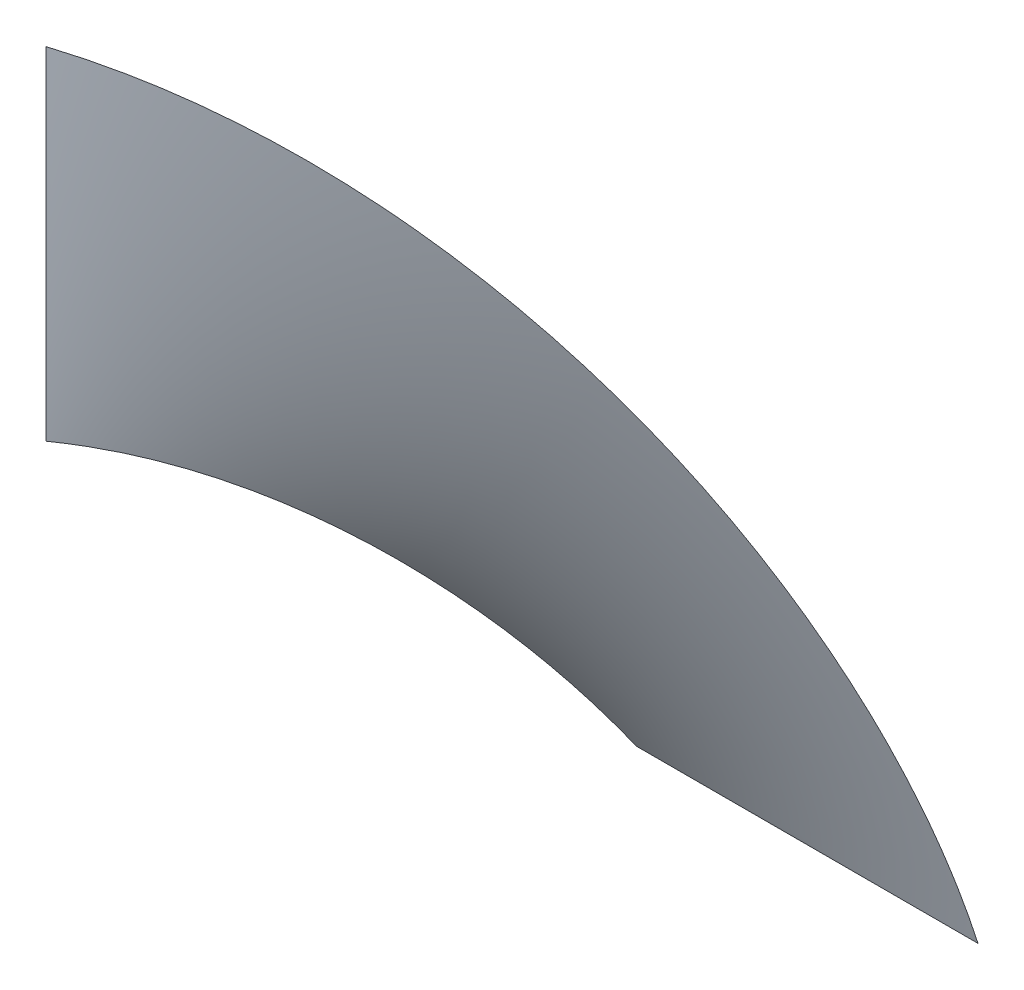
ISO-10303-21;
HEADER;
FILE_DESCRIPTION(('STEP AP214'),'2;1');
FILE_NAME('part.step','',(''),(''),'','','');
FILE_SCHEMA(('AUTOMOTIVE_DESIGN { 1 0 10303 214 1 1 1 1 }'));
ENDSEC;
DATA;
#1=APPLICATION_CONTEXT('core data for automotive mechanical design processes');
#2=APPLICATION_PROTOCOL_DEFINITION('international standard','automotive_design',2000,#1);
#3=PRODUCT_CONTEXT('',#1,'mechanical');
#4=PRODUCT('Part','Part','',(#3));
#5=PRODUCT_RELATED_PRODUCT_CATEGORY('part','',(#4));
#6=PRODUCT_DEFINITION_FORMATION('','',#4);
#7=PRODUCT_DEFINITION_CONTEXT('part definition',#1,'design');
#8=PRODUCT_DEFINITION('design','',#6,#7);
#9=PRODUCT_DEFINITION_SHAPE('','',#8);
#10=(LENGTH_UNIT() NAMED_UNIT(*) SI_UNIT(.MILLI.,.METRE.));
#11=(NAMED_UNIT(*) PLANE_ANGLE_UNIT() SI_UNIT($,.RADIAN.));
#12=(NAMED_UNIT(*) SI_UNIT($,.STERADIAN.) SOLID_ANGLE_UNIT());
#13=UNCERTAINTY_MEASURE_WITH_UNIT(LENGTH_MEASURE(1.E-05),#10,'distance_accuracy_value','');
#14=(GEOMETRIC_REPRESENTATION_CONTEXT(3) GLOBAL_UNCERTAINTY_ASSIGNED_CONTEXT((#13)) GLOBAL_UNIT_ASSIGNED_CONTEXT((#10,
#11,#12)) REPRESENTATION_CONTEXT('',''));
#15=CARTESIAN_POINT('',(0.,0.,0.));
#16=DIRECTION('',(0.,0.,1.));
#17=DIRECTION('',(1.,0.,0.));
#18=AXIS2_PLACEMENT_3D('',#15,#16,#17);
#19=CARTESIAN_POINT('',(45.,0.,0.));
#20=CARTESIAN_POINT('',(100.,0.,0.));
#21=CARTESIAN_POINT('',(44.2475850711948,0.752414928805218,0.));
#22=CARTESIAN_POINT('',(100.,3.26944159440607,1.03875395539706));
#23=CARTESIAN_POINT('',(43.464798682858,1.535201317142,0.0654102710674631));
#24=CARTESIAN_POINT('',(99.8392743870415,6.54488806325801,2.08324255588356));
#25=CARTESIAN_POINT('',(41.8423863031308,3.15761369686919,0.334948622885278));
#26=CARTESIAN_POINT('',(99.1974780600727,13.0604983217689,4.16863714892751));
#27=CARTESIAN_POINT('',(41.0027603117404,3.9972396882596,0.5390767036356));
#28=CARTESIAN_POINT('',(98.7173149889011,16.2974446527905,5.20641680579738));
#29=CARTESIAN_POINT('',(39.2705720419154,5.7294279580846,1.09394794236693));
#30=CARTESIAN_POINT('',(97.4401798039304,22.718414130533,7.29143508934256));
#31=CARTESIAN_POINT('',(38.3780191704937,6.62198082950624,1.44480023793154));
#32=CARTESIAN_POINT('',(96.6431605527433,25.8996599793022,8.33609578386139));
#33=CARTESIAN_POINT('',(36.5467154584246,8.45328454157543,2.29652015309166));
#34=CARTESIAN_POINT('',(94.7446767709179,32.1580330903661,10.4146601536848));
#35=CARTESIAN_POINT('',(35.607964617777,9.39203538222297,2.79738777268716));
#36=CARTESIAN_POINT('',(93.6404682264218,35.2445745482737,11.4579299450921));
#37=CARTESIAN_POINT('',(33.6909844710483,11.3090155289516,3.95232030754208));
#38=CARTESIAN_POINT('',(91.1348123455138,41.2936230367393,13.5436324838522));
#39=CARTESIAN_POINT('',(32.7128046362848,12.2871953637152,4.60644043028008));
#40=CARTESIAN_POINT('',(89.7356210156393,44.2519127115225,14.5815342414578));
#41=CARTESIAN_POINT('',(30.7261606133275,14.2738393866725,6.06518817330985));
#42=CARTESIAN_POINT('',(86.6497954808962,50.0252576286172,16.6661078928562));
#43=CARTESIAN_POINT('',(29.7176964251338,15.2823035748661,6.86981579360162));
#44=CARTESIAN_POINT('',(84.9635831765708,52.83829852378,17.7109062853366));
#45=CARTESIAN_POINT('',(28.189108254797,16.810891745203,8.18753768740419));
#46=CARTESIAN_POINT('',(82.2380542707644,56.9172776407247,19.2705711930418));
#47=CARTESIAN_POINT('',(27.6769509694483,17.3230490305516,8.64523533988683));
#48=CARTESIAN_POINT('',(81.2963620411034,58.2544390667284,19.7901997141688));
#49=CARTESIAN_POINT('',(26.6486885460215,18.3513114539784,9.59641717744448));
#50=CARTESIAN_POINT('',(79.3466645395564,60.8833719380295,20.8323625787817));
#51=CARTESIAN_POINT('',(26.1325834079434,18.8674165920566,10.0899013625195));
#52=CARTESIAN_POINT('',(78.3391095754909,62.1744597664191,21.3541175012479));
#53=CARTESIAN_POINT('',(25.0977332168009,19.9022667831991,11.1115287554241));
#54=CARTESIAN_POINT('',(76.262180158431,64.7051730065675,22.3970885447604));
#55=CARTESIAN_POINT('',(24.5789881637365,20.4210118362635,11.6396719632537));
#56=CARTESIAN_POINT('',(75.1928072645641,65.9447966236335,22.9183039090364));
#57=CARTESIAN_POINT('',(23.5401660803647,21.4598339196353,12.7294898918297));
#58=CARTESIAN_POINT('',(72.9962792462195,68.3682505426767,23.958315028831));
#59=CARTESIAN_POINT('',(23.0200890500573,21.9799109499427,13.2911646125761));
#60=CARTESIAN_POINT('',(71.8687235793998,69.5526023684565,24.477735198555));
#61=CARTESIAN_POINT('',(21.4598218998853,23.5401781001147,15.0247947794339));
#62=CARTESIAN_POINT('',(68.3973624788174,73.0240543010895,26.0407807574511));
#63=CARTESIAN_POINT('',(20.4196918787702,24.5803081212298,16.2452493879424));
#64=CARTESIAN_POINT('',(65.9671179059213,75.2265828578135,27.0856824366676));
#65=CARTESIAN_POINT('',(18.8674165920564,26.1325834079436,18.1623089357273));
#66=CARTESIAN_POINT('',(62.174317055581,78.3391929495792,28.6460381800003));
#67=CARTESIAN_POINT('',(18.3513114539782,26.6486885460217,18.8157250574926));
#68=CARTESIAN_POINT('',(60.8853249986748,79.3451629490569,29.1652847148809));
#69=CARTESIAN_POINT('',(17.3230490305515,27.6769509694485,20.14957082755));
#70=CARTESIAN_POINT('',(58.2566728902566,81.2947584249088,30.2071740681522));
#71=CARTESIAN_POINT('',(16.8108917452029,28.1891082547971,20.8300004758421));
#72=CARTESIAN_POINT('',(56.9177640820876,82.2377517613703,30.7288818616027));
#73=CARTESIAN_POINT('',(15.7918329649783,29.2081670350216,22.2160942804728));
#74=CARTESIAN_POINT('',(54.1955685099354,84.0566477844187,31.7719384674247));
#75=CARTESIAN_POINT('',(15.2849522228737,29.7150477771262,22.9217187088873));
#76=CARTESIAN_POINT('',(52.8122837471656,84.932549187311,32.2932865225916));
#77=CARTESIAN_POINT('',(14.2776249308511,30.7223750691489,24.3559462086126));
#78=CARTESIAN_POINT('',(50.006443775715,86.6142644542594,33.3337412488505));
#79=CARTESIAN_POINT('',(13.777178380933,31.222821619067,25.0845492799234));
#80=CARTESIAN_POINT('',(48.5839205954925,87.4201354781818,33.8528488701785));
#81=CARTESIAN_POINT('',(12.2871953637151,32.7128046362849,27.3015618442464));
#82=CARTESIAN_POINT('',(44.2547289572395,89.7342112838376,35.415458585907));
#83=CARTESIAN_POINT('',(11.3090155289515,33.6909844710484,28.8211746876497));
#84=CARTESIAN_POINT('',(41.289719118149,91.1364989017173,36.4604291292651));
#85=CARTESIAN_POINT('',(9.87128041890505,35.1287195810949,31.1499421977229));
#86=CARTESIAN_POINT('',(36.7560692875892,93.0143373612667,38.0214248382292));
#87=CARTESIAN_POINT('',(9.39697019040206,35.6030298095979,31.9343814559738));
#88=CARTESIAN_POINT('',(35.2307968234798,93.6027142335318,38.5404282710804));
#89=CARTESIAN_POINT('',(8.45905928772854,36.5409407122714,33.5173625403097));
#90=CARTESIAN_POINT('',(32.1496992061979,94.7051951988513,39.5820100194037));
#91=CARTESIAN_POINT('',(7.995458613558,37.0045413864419,34.3159043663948));
#92=CARTESIAN_POINT('',(30.5947727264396,95.2189038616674,40.1036535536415));
#93=CARTESIAN_POINT('',(7.07980675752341,37.9201932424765,35.9248263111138));
#94=CARTESIAN_POINT('',(27.4617469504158,96.1692894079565,41.1467615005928));
#95=CARTESIAN_POINT('',(6.62775557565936,38.3722444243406,36.7352064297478));
#96=CARTESIAN_POINT('',(25.8836499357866,96.6059656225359,41.6682251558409));
#97=CARTESIAN_POINT('',(5.73604264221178,39.2639573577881,38.3655406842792));
#98=CARTESIAN_POINT('',(22.710034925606,97.4008739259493,42.7090895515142));
#99=CARTESIAN_POINT('',(5.29638089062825,39.7036191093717,39.1854948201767));
#100=CARTESIAN_POINT('',(21.1150082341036,97.7590573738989,43.2280235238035));
#101=CARTESIAN_POINT('',(3.99723968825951,41.0027603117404,41.6563218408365));
#102=CARTESIAN_POINT('',(16.3009892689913,98.7166917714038,44.7901462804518));
#103=CARTESIAN_POINT('',(3.15761369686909,41.8423863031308,43.3180292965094));
#104=CARTESIAN_POINT('',(13.0565585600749,99.1979400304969,45.8351512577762));
#105=CARTESIAN_POINT('',(1.94080441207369,43.0591955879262,45.8198961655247));
#106=CARTESIAN_POINT('',(8.17240398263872,99.6789249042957,47.3967359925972));
#107=CARTESIAN_POINT('',(1.5423062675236,43.4576937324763,46.6554027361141));
#108=CARTESIAN_POINT('',(6.54212050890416,99.799184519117,47.9156352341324));
#109=CARTESIAN_POINT('',(0.760007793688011,44.2399922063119,48.3274463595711));
#110=CARTESIAN_POINT('',(3.27401781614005,99.9597788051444,48.9568753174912));
#111=CARTESIAN_POINT('',(0.376207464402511,44.6237925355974,49.1639834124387));
#112=CARTESIAN_POINT('',(1.63700950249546,100.,49.4784374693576));
#113=CARTESIAN_POINT('',(-1.01154186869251E-13,45.,50.));
#114=CARTESIAN_POINT('',(-1.57342736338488E-13,100.,50.));
#115=B_SPLINE_SURFACE_WITH_KNOTS('',3,1,((#19,#20),(#21,#22),(#23,#24),(#25,#26),(#27,#28),(#29,
#30),(#31,#32),(#33,#34),(#35,#36),(#37,#38),(#39,#40),(#41,#42),(#43,#44),(#45,#46),(#47,#48),
(#49,#50),(#51,#52),(#53,#54),(#55,#56),(#57,#58),(#59,#60),(#61,#62),(#63,#64),(#65,#66),(#67,
#68),(#69,#70),(#71,#72),(#73,#74),(#75,#76),(#77,#78),(#79,#80),(#81,#82),(#83,#84),(#85,#86),
(#87,#88),(#89,#90),(#91,#92),(#93,#94),(#95,#96),(#97,#98),(#99,#100),(#101,#102),(#103,#104),
(#105,#106),(#107,#108),(#109,#110),(#111,#112),(#113,#114)),.UNSPECIFIED.,.F.,.F.,.F.,(4,2,2,2,
2,2,2,2,2,2,2,2,2,2,2,2,2,2,2,2,2,2,2,4),(2,2),(0.,0.0625000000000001,0.125,0.1875,0.25,
0.312500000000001,0.375,0.406250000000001,0.437500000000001,0.468750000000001,0.5,
0.562500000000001,0.593750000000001,0.625,0.656250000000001,0.687500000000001,0.75,
0.781250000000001,0.812500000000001,0.843750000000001,0.875,0.9375,0.96875,1.),(0.,1.),.UNSPECIFIED.);
#116=CARTESIAN_POINT('',(100.,0.,0.));
#117=CARTESIAN_POINT('',(100.,7.4939640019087,2.38095238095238));
#118=CARTESIAN_POINT('',(98.8830826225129,14.9042266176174,4.76190476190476));
#119=CARTESIAN_POINT('',(97.7661652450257,22.3144892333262,7.14285714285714));
#120=CARTESIAN_POINT('',(95.5572805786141,29.4755174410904,9.52380952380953));
#121=CARTESIAN_POINT('',(93.3483959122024,36.6365456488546,11.9047619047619));
#122=CARTESIAN_POINT('',(90.0968867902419,43.3883739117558,14.2857142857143));
#123=CARTESIAN_POINT('',(86.8453776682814,50.140202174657,16.6666666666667));
#124=CARTESIAN_POINT('',(82.6238774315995,56.3320058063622,19.0476190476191));
#125=CARTESIAN_POINT('',(78.4023771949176,62.5238094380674,21.4285714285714));
#126=CARTESIAN_POINT('',(73.3051871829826,68.0172737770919,23.8095238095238));
#127=CARTESIAN_POINT('',(68.2079971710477,73.5107381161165,26.1904761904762));
#128=CARTESIAN_POINT('',(62.3489801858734,78.183148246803,28.5714285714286));
#129=CARTESIAN_POINT('',(56.489963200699,82.8555583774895,30.952380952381));
#130=CARTESIAN_POINT('',(50.,86.6025403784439,33.3333333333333));
#131=CARTESIAN_POINT('',(43.510036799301,90.3495223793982,35.7142857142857));
#132=CARTESIAN_POINT('',(36.5341024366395,93.0873748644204,38.0952380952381));
#133=CARTESIAN_POINT('',(29.558168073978,95.8252273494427,40.4761904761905));
#134=CARTESIAN_POINT('',(22.2520933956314,97.4927912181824,42.8571428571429));
#135=CARTESIAN_POINT('',(14.9460187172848,99.1603550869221,45.2380952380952));
#136=CARTESIAN_POINT('',(7.47300935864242,99.720379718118,47.6190476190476));
#137=CARTESIAN_POINT('',(3.74173600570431,100.,48.8078570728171));
#138=CARTESIAN_POINT('',(-2.27132648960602E-13,100.,50.0000000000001));
#139=(BOUNDED_CURVE() B_SPLINE_CURVE(2,(#116,#117,#118,#119,#120,#121,#122,#123,#124,#125,#126,
#127,#128,#129,#130,#131,#132,#133,#134,#135,#136,#137,#138),.UNSPECIFIED.,.F.,
.F.) B_SPLINE_CURVE_WITH_KNOTS((3,2,2,2,2,2,2,2,2,2,2,3),(0.,0.0238095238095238,
0.0476190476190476,0.0714285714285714,0.0952380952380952,0.119047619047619,0.142857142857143,
0.166666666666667,0.19047619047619,0.214285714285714,0.238095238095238,0.25),
.UNSPECIFIED.) CURVE() GEOMETRIC_REPRESENTATION_ITEM() RATIONAL_B_SPLINE_CURVE((1.,
0.99720379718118,1.,0.99720379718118,1.,0.99720379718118,1.,0.99720379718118,1.,
0.99720379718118,1.,0.99720379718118,1.,0.99720379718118,1.,0.99720379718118,1.,
0.99720379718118,1.,0.99720379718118,1.,0.99860189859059,0.99860189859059)) REPRESENTATION_ITEM(''));
#140=CARTESIAN_POINT('',(100.,0.,0.));
#141=VERTEX_POINT('',#140);
#142=CARTESIAN_POINT('',(98.8430173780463,15.1677821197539,4.84661208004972));
#143=VERTEX_POINT('',#142);
#144=EDGE_CURVE('E136',#141,#143,#139,.T.);
#145=DIRECTION('',(1.,0.,0.));
#146=VECTOR('',#145,1.);
#147=CARTESIAN_POINT('',(72.5,0.,0.));
#148=LINE('',#147,#146);
#149=CARTESIAN_POINT('',(45.,0.,0.));
#150=VERTEX_POINT('',#149);
#151=EDGE_CURVE('E149',#150,#141,#148,.T.);
#152=CARTESIAN_POINT('',(45.,0.,0.));
#153=CARTESIAN_POINT('',(45.0000004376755,0.102509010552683,1.87982970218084E-05));
#154=CARTESIAN_POINT('',(44.9996497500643,0.204999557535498,0.00200479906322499));
#155=CARTESIAN_POINT('',(44.9982501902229,0.409822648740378,0.00944008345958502));
#156=CARTESIAN_POINT('',(44.9972015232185,0.512155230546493,0.014888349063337));
#157=CARTESIAN_POINT('',(44.9944162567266,0.71614828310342,0.0287468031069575));
#158=CARTESIAN_POINT('',(44.992682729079,0.817809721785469,0.037143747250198));
#159=CARTESIAN_POINT('',(44.9885333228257,1.02087399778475,0.0565511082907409));
#160=CARTESIAN_POINT('',(44.9861173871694,1.12227681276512,0.0675617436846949));
#161=CARTESIAN_POINT('',(44.9778643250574,1.42569884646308,0.104009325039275));
#162=CARTESIAN_POINT('',(44.9710171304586,1.62728117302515,0.132887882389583));
#163=CARTESIAN_POINT('',(44.9546805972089,2.02906785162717,0.197979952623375));
#164=CARTESIAN_POINT('',(44.9451919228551,2.22927253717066,0.234191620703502));
#165=CARTESIAN_POINT('',(44.9236881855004,2.62710364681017,0.312405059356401));
#166=CARTESIAN_POINT('',(44.9116892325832,2.82473836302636,0.354369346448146));
#167=CARTESIAN_POINT('',(44.8851640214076,3.2188653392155,0.443328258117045));
#168=CARTESIAN_POINT('',(44.8706356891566,3.41535652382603,0.490326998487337));
#169=CARTESIAN_POINT('',(44.8390892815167,3.80719466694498,0.588631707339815));
#170=CARTESIAN_POINT('',(44.8220695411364,4.00254076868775,0.639940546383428));
#171=CARTESIAN_POINT('',(44.7855806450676,4.39204249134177,0.74628803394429));
#172=CARTESIAN_POINT('',(44.7661107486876,4.58619773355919,0.80132780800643));
#173=CARTESIAN_POINT('',(44.697785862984,5.22582139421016,0.988578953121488));
#174=CARTESIAN_POINT('',(44.6437325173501,5.66870395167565,1.12779160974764));
#175=CARTESIAN_POINT('',(44.5232103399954,6.54834567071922,1.41943019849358));
#176=CARTESIAN_POINT('',(44.4567408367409,6.98510449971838,1.57185684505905));
#177=CARTESIAN_POINT('',(44.3116785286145,7.85294535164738,1.88725045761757));
#178=CARTESIAN_POINT('',(44.2330810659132,8.2840251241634,2.05022145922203));
#179=CARTESIAN_POINT('',(44.0640429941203,9.14060924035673,2.38477580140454));
#180=CARTESIAN_POINT('',(43.9735991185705,9.56611201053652,2.55636150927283));
#181=CARTESIAN_POINT('',(43.7811598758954,10.4114322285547,2.90680184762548));
#182=CARTESIAN_POINT('',(43.6791652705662,10.8312500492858,3.08565599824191));
#183=CARTESIAN_POINT('',(43.4628456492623,11.6691932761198,3.45142871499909));
#184=CARTESIAN_POINT('',(43.3484119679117,12.0872640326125,3.63840807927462));
#185=CARTESIAN_POINT('',(43.1083201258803,12.9174050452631,4.01793839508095));
#186=CARTESIAN_POINT('',(42.9826662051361,13.3294775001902,4.21048722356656));
#187=CARTESIAN_POINT('',(42.720363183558,14.1476175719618,4.60059394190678));
#188=CARTESIAN_POINT('',(42.5837158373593,14.5536861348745,4.79815102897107));
#189=CARTESIAN_POINT('',(42.2996412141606,15.3597840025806,5.19777024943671));
#190=CARTESIAN_POINT('',(42.1522140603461,15.7598133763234,5.3998323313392));
#191=CARTESIAN_POINT('',(41.8468052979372,16.5537247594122,5.80808470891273));
#192=CARTESIAN_POINT('',(41.6888227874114,16.947606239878,6.01427535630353));
#193=CARTESIAN_POINT('',(41.2541367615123,17.988687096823,6.56875266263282));
#194=CARTESIAN_POINT('',(40.9682989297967,18.6303027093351,6.92042087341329));
#195=CARTESIAN_POINT('',(40.3691048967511,19.8953606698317,7.63325729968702));
#196=CARTESIAN_POINT('',(40.0557414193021,20.5187981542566,7.99442800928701));
#197=CARTESIAN_POINT('',(39.4026175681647,21.7466627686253,8.72542010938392));
#198=CARTESIAN_POINT('',(39.0628523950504,22.3510864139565,9.09524306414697));
#199=CARTESIAN_POINT('',(38.3581648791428,23.5399375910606,9.84295630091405));
#200=CARTESIAN_POINT('',(37.9932425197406,24.1243651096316,10.2208465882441));
#201=CARTESIAN_POINT('',(37.2408937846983,25.2702169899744,10.9830215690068));
#202=CARTESIAN_POINT('',(36.8535553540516,25.8317182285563,11.3672775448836));
#203=CARTESIAN_POINT('',(36.0564420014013,26.9331591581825,12.143145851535));
#204=CARTESIAN_POINT('',(35.6466697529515,27.4731014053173,12.5347573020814));
#205=CARTESIAN_POINT('',(34.8059589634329,28.5307119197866,13.3252066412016));
#206=CARTESIAN_POINT('',(34.3750212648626,29.0483810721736,13.7240442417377));
#207=CARTESIAN_POINT('',(33.493352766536,30.0607028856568,14.5289168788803));
#208=CARTESIAN_POINT('',(33.04262237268,30.5553560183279,14.9349517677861));
#209=CARTESIAN_POINT('',(31.9635927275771,31.6880792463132,15.8964486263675));
#210=CARTESIAN_POINT('',(31.3278505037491,32.3165001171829,16.4549680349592));
#211=CARTESIAN_POINT('',(30.0269000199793,33.5287319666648,17.5858975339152));
#212=CARTESIAN_POINT('',(29.3616909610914,34.1125417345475,18.1583080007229));
#213=CARTESIAN_POINT('',(28.0056708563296,35.2343096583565,19.3175393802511));
#214=CARTESIAN_POINT('',(27.3148598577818,35.7722678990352,19.9043602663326));
#215=CARTESIAN_POINT('',(25.910531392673,36.8022298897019,21.0947307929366));
#216=CARTESIAN_POINT('',(25.1969708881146,37.2941386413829,21.6983118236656));
#217=CARTESIAN_POINT('',(23.7531027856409,38.229965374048,22.9223709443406));
#218=CARTESIAN_POINT('',(23.0227953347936,38.6738837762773,23.5428488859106));
#219=CARTESIAN_POINT('',(21.5502451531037,39.5133534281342,24.8021480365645));
#220=CARTESIAN_POINT('',(20.8080021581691,39.9089036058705,25.4409696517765));
#221=CARTESIAN_POINT('',(19.4464615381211,40.5870530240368,26.6258837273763));
#222=CARTESIAN_POINT('',(18.828211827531,40.8773358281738,27.1688004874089));
#223=CARTESIAN_POINT('',(17.5903178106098,41.4250985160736,28.2694977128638));
#224=CARTESIAN_POINT('',(16.9706734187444,41.6825763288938,28.8272791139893));
#225=CARTESIAN_POINT('',(15.7333671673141,42.1651769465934,29.9589609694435));
#226=CARTESIAN_POINT('',(15.1157055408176,42.3902960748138,30.5328632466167));
#227=CARTESIAN_POINT('',(13.8860200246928,42.8088818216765,31.6982669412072));
#228=CARTESIAN_POINT('',(13.2739973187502,43.0023419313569,32.2897719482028));
#229=CARTESIAN_POINT('',(12.0618407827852,43.3579227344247,33.4894674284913));
#230=CARTESIAN_POINT('',(11.4616716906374,43.5201553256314,34.0975890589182));
#231=CARTESIAN_POINT('',(10.2751172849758,43.8154731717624,35.3339838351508));
#232=CARTESIAN_POINT('',(9.68873120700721,43.9485600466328,35.9622558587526));
#233=CARTESIAN_POINT('',(8.5344364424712,44.1872224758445,37.2402512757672));
#234=CARTESIAN_POINT('',(7.96652165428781,44.2928071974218,37.8899674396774));
#235=CARTESIAN_POINT('',(6.85403497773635,44.4785344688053,39.2123176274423));
#236=CARTESIAN_POINT('',(6.30945504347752,44.5586858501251,39.8849436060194));
#237=CARTESIAN_POINT('',(5.49755459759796,44.6638292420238,40.9332051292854));
#238=CARTESIAN_POINT('',(5.22000739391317,44.6970589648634,41.3001467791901));
#239=CARTESIAN_POINT('',(4.67377552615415,44.7574717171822,42.0409860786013));
#240=CARTESIAN_POINT('',(4.40508949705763,44.7846556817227,42.4148826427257));
#241=CARTESIAN_POINT('',(3.87745228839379,44.8334200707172,43.1697161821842));
#242=CARTESIAN_POINT('',(3.61849889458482,44.8550017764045,43.5506515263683));
#243=CARTESIAN_POINT('',(3.11118824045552,44.8930417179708,44.3196557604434));
#244=CARTESIAN_POINT('',(2.86282874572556,44.9095010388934,44.7077231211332));
#245=CARTESIAN_POINT('',(2.37637925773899,44.9378734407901,45.4930016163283));
#246=CARTESIAN_POINT('',(2.13834443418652,44.9497642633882,45.8902477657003));
#247=CARTESIAN_POINT('',(1.67470681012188,44.9694252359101,46.6921121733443));
#248=CARTESIAN_POINT('',(1.44910578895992,44.9771947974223,47.0967314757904));
#249=CARTESIAN_POINT('',(1.01120272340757,44.9891704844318,47.9134335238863));
#250=CARTESIAN_POINT('',(0.798907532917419,44.9933747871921,48.3255199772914));
#251=CARTESIAN_POINT('',(0.388499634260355,44.9987918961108,49.1572351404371));
#252=CARTESIAN_POINT('',(0.19040166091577,45.0000016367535,49.5768711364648));
#253=CARTESIAN_POINT('',(-1.01154186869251E-13,45.,50.));
#254=B_SPLINE_CURVE_WITH_KNOTS('',3,(#152,#153,#154,#155,#156,#157,#158,#159,#160,#161,#162,
#163,#164,#165,#166,#167,#168,#169,#170,#171,#172,#173,#174,#175,#176,#177,#178,#179,#180,#181,
#182,#183,#184,#185,#186,#187,#188,#189,#190,#191,#192,#193,#194,#195,#196,#197,#198,#199,#200,
#201,#202,#203,#204,#205,#206,#207,#208,#209,#210,#211,#212,#213,#214,#215,#216,#217,#218,#219,
#220,#221,#222,#223,#224,#225,#226,#227,#228,#229,#230,#231,#232,#233,#234,#235,#236,#237,#238,
#239,#240,#241,#242,#243,#244,#245,#246,#247,#248,#249,#250,#251,#252,#253),.UNSPECIFIED.,.F.,
.F.,(4,2,2,2,2,2,2,2,2,2,2,2,2,2,2,2,2,2,2,2,2,2,2,2,2,2,2,2,2,2,2,2,2,2,2,2,2,2,2,2,2,2,2,2,2,
2,2,2,2,2,4),(0.,0.30748121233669,0.614872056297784,0.920899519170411,1.2269525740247,
1.8380083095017,2.44891051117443,3.05600623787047,3.6636021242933,4.27160593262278,
4.87979398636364,6.28142528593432,7.68313241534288,9.08537922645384,10.4880135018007,
11.8905553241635,13.3065200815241,14.7219520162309,16.1371584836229,17.5523487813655,
18.9676601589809,21.3233993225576,23.6797630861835,26.0365562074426,28.3933508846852,
30.7414549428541,33.0892797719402,35.4370112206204,37.7846945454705,40.9453085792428,
44.1060083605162,47.2667022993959,50.4337792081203,53.6008283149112,56.7679475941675,
59.3847317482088,62.0016810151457,64.6189273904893,67.2367111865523,69.844932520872,
72.4530088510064,75.060214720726,77.666514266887,79.0502180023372,80.4337075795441,
81.8168804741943,83.1997601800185,84.5892945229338,85.9790272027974,87.3694699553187,
88.7613355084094),.UNSPECIFIED.);
#255=CARTESIAN_POINT('',(-1.01154186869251E-13,45.,50.));
#256=VERTEX_POINT('',#255);
#257=EDGE_CURVE('E43',#150,#256,#254,.T.);
#258=DIRECTION('',(0.,-1.,0.));
#259=VECTOR('',#258,1.);
#260=CARTESIAN_POINT('',(-1.64703742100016E-13,72.5,50.0000000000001));
#261=LINE('',#260,#259);
#262=CARTESIAN_POINT('',(-2.27132648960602E-13,100.,50.0000000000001));
#263=VERTEX_POINT('',#262);
#264=EDGE_CURVE('E152',#263,#256,#261,.T.);
#265=CARTESIAN_POINT('',(-1.57342736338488E-13,100.,50.));
#266=CARTESIAN_POINT('',(1.63700950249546,100.,49.4784374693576));
#267=CARTESIAN_POINT('',(3.27401781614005,99.9597788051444,48.9568753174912));
#268=CARTESIAN_POINT('',(6.54212050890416,99.799184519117,47.9156352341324));
#269=CARTESIAN_POINT('',(8.17240398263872,99.6789249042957,47.3967359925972));
#270=CARTESIAN_POINT('',(13.0565585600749,99.1979400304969,45.8351512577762));
#271=CARTESIAN_POINT('',(16.3009892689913,98.7166917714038,44.7901462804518));
#272=CARTESIAN_POINT('',(21.1150082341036,97.7590573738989,43.2280235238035));
#273=CARTESIAN_POINT('',(22.710034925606,97.4008739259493,42.7090895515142));
#274=CARTESIAN_POINT('',(25.8836499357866,96.6059656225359,41.6682251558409));
#275=CARTESIAN_POINT('',(27.4617469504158,96.1692894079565,41.1467615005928));
#276=CARTESIAN_POINT('',(30.5947727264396,95.2189038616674,40.1036535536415));
#277=CARTESIAN_POINT('',(32.1496992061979,94.7051951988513,39.5820100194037));
#278=CARTESIAN_POINT('',(35.2307968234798,93.6027142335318,38.5404282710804));
#279=CARTESIAN_POINT('',(36.7560692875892,93.0143373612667,38.0214248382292));
#280=CARTESIAN_POINT('',(41.289719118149,91.1364989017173,36.4604291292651));
#281=CARTESIAN_POINT('',(44.2547289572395,89.7342112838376,35.415458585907));
#282=CARTESIAN_POINT('',(48.5839205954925,87.4201354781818,33.8528488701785));
#283=CARTESIAN_POINT('',(50.006443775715,86.6142644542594,33.3337412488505));
#284=CARTESIAN_POINT('',(52.8122837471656,84.932549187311,32.2932865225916));
#285=CARTESIAN_POINT('',(54.1955685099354,84.0566477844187,31.7719384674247));
#286=CARTESIAN_POINT('',(56.9177640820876,82.2377517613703,30.7288818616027));
#287=CARTESIAN_POINT('',(58.2566728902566,81.2947584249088,30.2071740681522));
#288=CARTESIAN_POINT('',(60.8853249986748,79.3451629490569,29.1652847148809));
#289=CARTESIAN_POINT('',(62.174317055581,78.3391929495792,28.6460381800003));
#290=CARTESIAN_POINT('',(65.9671179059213,75.2265828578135,27.0856824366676));
#291=CARTESIAN_POINT('',(68.3973624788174,73.0240543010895,26.0407807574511));
#292=CARTESIAN_POINT('',(71.8687235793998,69.5526023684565,24.477735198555));
#293=CARTESIAN_POINT('',(72.9962792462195,68.3682505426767,23.958315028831));
#294=CARTESIAN_POINT('',(75.1928072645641,65.9447966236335,22.9183039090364));
#295=CARTESIAN_POINT('',(76.262180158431,64.7051730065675,22.3970885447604));
#296=CARTESIAN_POINT('',(78.3391095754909,62.1744597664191,21.3541175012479));
#297=CARTESIAN_POINT('',(79.3466645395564,60.8833719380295,20.8323625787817));
#298=CARTESIAN_POINT('',(81.2963620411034,58.2544390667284,19.7901997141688));
#299=CARTESIAN_POINT('',(82.2380542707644,56.9172776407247,19.2705711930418));
#300=CARTESIAN_POINT('',(84.9635831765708,52.83829852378,17.7109062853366));
#301=CARTESIAN_POINT('',(86.6497954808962,50.0252576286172,16.6661078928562));
#302=CARTESIAN_POINT('',(89.7356210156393,44.2519127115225,14.5815342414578));
#303=CARTESIAN_POINT('',(91.1348123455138,41.2936230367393,13.5436324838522));
#304=CARTESIAN_POINT('',(93.6404682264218,35.2445745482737,11.4579299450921));
#305=CARTESIAN_POINT('',(94.7446767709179,32.1580330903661,10.4146601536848));
#306=CARTESIAN_POINT('',(96.6431605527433,25.8996599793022,8.33609578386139));
#307=CARTESIAN_POINT('',(97.4401798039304,22.718414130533,7.29143508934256));
#308=CARTESIAN_POINT('',(98.7173149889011,16.2974446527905,5.20641680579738));
#309=CARTESIAN_POINT('',(99.1974780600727,13.0604983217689,4.16863714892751));
#310=CARTESIAN_POINT('',(99.8392743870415,6.54488806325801,2.08324255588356));
#311=CARTESIAN_POINT('',(100.,3.26944159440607,1.03875395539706));
#312=CARTESIAN_POINT('',(100.,0.,0.));
#313=B_SPLINE_CURVE_WITH_KNOTS('',3,(#265,#266,#267,#268,#269,#270,#271,#272,#273,#274,#275,
#276,#277,#278,#279,#280,#281,#282,#283,#284,#285,#286,#287,#288,#289,#290,#291,#292,#293,#294,
#295,#296,#297,#298,#299,#300,#301,#302,#303,#304,#305,#306,#307,#308,#309,#310,#311,#312),
.UNSPECIFIED.,.F.,.F.,(4,2,2,2,2,2,2,2,2,2,2,2,2,2,2,2,2,2,2,2,2,2,2,4),(0.,0.0312499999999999,
0.0624999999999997,0.125,0.156249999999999,0.187499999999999,0.218749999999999,0.25,
0.312499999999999,0.343749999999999,0.375,0.406249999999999,0.437499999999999,0.5,
0.531249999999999,0.562499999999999,0.593749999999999,0.625,0.687499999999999,0.75,0.8125,0.875,
0.9375,1.),.UNSPECIFIED.);
#314=EDGE_CURVE('E153',#263,#143,#313,.T.);
#315=ORIENTED_EDGE('',*,*,#144,.F.);
#316=ORIENTED_EDGE('',*,*,#151,.F.);
#317=ORIENTED_EDGE('',*,*,#257,.T.);
#318=ORIENTED_EDGE('',*,*,#264,.F.);
#319=ORIENTED_EDGE('',*,*,#314,.T.);
#320=EDGE_LOOP('',(#315,#316,#317,#318,#319));
#321=FACE_BOUND('',#320,.T.);
#322=ADVANCED_FACE('F115',(#321),#115,.T.);
#323=CARTESIAN_POINT('',(45.,0.,0.));
#324=CARTESIAN_POINT('',(45.,3.37228380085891,2.38095238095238));
#325=CARTESIAN_POINT('',(44.4973871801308,6.70690197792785,4.76190476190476));
#326=CARTESIAN_POINT('',(43.9947743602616,10.0415201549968,7.14285714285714));
#327=CARTESIAN_POINT('',(43.0007762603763,13.2639828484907,9.52380952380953));
#328=CARTESIAN_POINT('',(42.0067781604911,16.4864455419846,11.9047619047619));
#329=CARTESIAN_POINT('',(40.5435990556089,19.5247682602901,14.2857142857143));
#330=CARTESIAN_POINT('',(39.0804199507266,22.5630909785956,16.6666666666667));
#331=CARTESIAN_POINT('',(37.1807448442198,25.349402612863,19.0476190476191));
#332=CARTESIAN_POINT('',(35.2810697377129,28.1357142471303,21.4285714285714));
#333=CARTESIAN_POINT('',(32.9873342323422,30.6077731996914,23.8095238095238));
#334=CARTESIAN_POINT('',(30.6935987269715,33.0798321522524,26.1904761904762));
#335=CARTESIAN_POINT('',(28.057041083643,35.1824167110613,28.5714285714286));
#336=CARTESIAN_POINT('',(25.4204834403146,37.2850012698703,30.952380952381));
#337=CARTESIAN_POINT('',(22.5,38.9711431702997,33.3333333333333));
#338=CARTESIAN_POINT('',(19.5795165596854,40.6572850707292,35.7142857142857));
#339=CARTESIAN_POINT('',(16.4403460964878,41.8893186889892,38.0952380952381));
#340=CARTESIAN_POINT('',(13.3011756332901,43.1213523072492,40.4761904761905));
#341=CARTESIAN_POINT('',(10.0134420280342,43.8717560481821,42.8571428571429));
#342=CARTESIAN_POINT('',(6.72570842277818,44.6221597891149,45.2380952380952));
#343=CARTESIAN_POINT('',(3.36285421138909,44.8741708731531,47.6190476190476));
#344=CARTESIAN_POINT('',(1.68378120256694,45.,48.8078570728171));
#345=CARTESIAN_POINT('',(-1.0227483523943E-13,45.,50.0000000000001));
#346=CARTESIAN_POINT('',(100.,0.,0.));
#347=CARTESIAN_POINT('',(100.,7.4939640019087,2.38095238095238));
#348=CARTESIAN_POINT('',(98.8830826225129,14.9042266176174,4.76190476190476));
#349=CARTESIAN_POINT('',(97.7661652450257,22.3144892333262,7.14285714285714));
#350=CARTESIAN_POINT('',(95.5572805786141,29.4755174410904,9.52380952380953));
#351=CARTESIAN_POINT('',(93.3483959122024,36.6365456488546,11.9047619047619));
#352=CARTESIAN_POINT('',(90.0968867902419,43.3883739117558,14.2857142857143));
#353=CARTESIAN_POINT('',(86.8453776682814,50.140202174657,16.6666666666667));
#354=CARTESIAN_POINT('',(82.6238774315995,56.3320058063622,19.0476190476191));
#355=CARTESIAN_POINT('',(78.4023771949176,62.5238094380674,21.4285714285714));
#356=CARTESIAN_POINT('',(73.3051871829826,68.0172737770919,23.8095238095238));
#357=CARTESIAN_POINT('',(68.2079971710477,73.5107381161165,26.1904761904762));
#358=CARTESIAN_POINT('',(62.3489801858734,78.183148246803,28.5714285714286));
#359=CARTESIAN_POINT('',(56.489963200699,82.8555583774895,30.952380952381));
#360=CARTESIAN_POINT('',(50.,86.6025403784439,33.3333333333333));
#361=CARTESIAN_POINT('',(43.510036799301,90.3495223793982,35.7142857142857));
#362=CARTESIAN_POINT('',(36.5341024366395,93.0873748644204,38.0952380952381));
#363=CARTESIAN_POINT('',(29.558168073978,95.8252273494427,40.4761904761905));
#364=CARTESIAN_POINT('',(22.2520933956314,97.4927912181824,42.8571428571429));
#365=CARTESIAN_POINT('',(14.9460187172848,99.1603550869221,45.2380952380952));
#366=CARTESIAN_POINT('',(7.47300935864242,99.720379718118,47.6190476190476));
#367=CARTESIAN_POINT('',(3.74173600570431,100.,48.8078570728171));
#368=CARTESIAN_POINT('',(-2.27132648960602E-13,100.,50.0000000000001));
#369=(BOUNDED_SURFACE() B_SPLINE_SURFACE(1,2,((#323,#324,#325,#326,#327,#328,#329,#330,#331,
#332,#333,#334,#335,#336,#337,#338,#339,#340,#341,#342,#343,#344,#345),(#346,#347,#348,#349,
#350,#351,#352,#353,#354,#355,#356,#357,#358,#359,#360,#361,#362,#363,#364,#365,#366,#367,
#368)),.UNSPECIFIED.,.F.,.F.,.F.) B_SPLINE_SURFACE_WITH_KNOTS((2,2),(3,2,2,2,2,2,2,2,2,2,2,3),
(0.,1.),(0.,0.0238095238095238,0.0476190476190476,0.0714285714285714,0.0952380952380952,
0.119047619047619,0.142857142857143,0.166666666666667,0.19047619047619,0.214285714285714,
0.238095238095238,0.25),
.UNSPECIFIED.) GEOMETRIC_REPRESENTATION_ITEM() RATIONAL_B_SPLINE_SURFACE(((1.,0.99720379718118,
1.,0.99720379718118,1.,0.99720379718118,1.,0.99720379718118,1.,0.99720379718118,1.,
0.99720379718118,1.,0.99720379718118,1.,0.99720379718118,1.,0.99720379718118,1.,
0.99720379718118,1.,0.99860189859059,0.99860189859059),(1.,0.99720379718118,1.,0.99720379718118,
1.,0.99720379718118,1.,0.99720379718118,1.,0.99720379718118,1.,0.99720379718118,1.,
0.99720379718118,1.,0.99720379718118,1.,0.99720379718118,1.,0.99720379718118,1.,
0.99860189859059,0.99860189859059))) REPRESENTATION_ITEM('') SURFACE());
#370=CARTESIAN_POINT('',(45.,0.,0.));
#371=CARTESIAN_POINT('',(45.,3.37228380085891,2.38095238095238));
#372=CARTESIAN_POINT('',(44.4973871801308,6.70690197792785,4.76190476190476));
#373=CARTESIAN_POINT('',(43.9947743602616,10.0415201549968,7.14285714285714));
#374=CARTESIAN_POINT('',(43.0007762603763,13.2639828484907,9.52380952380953));
#375=CARTESIAN_POINT('',(42.0067781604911,16.4864455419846,11.9047619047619));
#376=CARTESIAN_POINT('',(40.5435990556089,19.5247682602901,14.2857142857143));
#377=CARTESIAN_POINT('',(39.0804199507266,22.5630909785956,16.6666666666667));
#378=CARTESIAN_POINT('',(37.1807448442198,25.349402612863,19.0476190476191));
#379=CARTESIAN_POINT('',(35.2810697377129,28.1357142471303,21.4285714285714));
#380=CARTESIAN_POINT('',(32.9873342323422,30.6077731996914,23.8095238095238));
#381=CARTESIAN_POINT('',(30.6935987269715,33.0798321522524,26.1904761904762));
#382=CARTESIAN_POINT('',(28.057041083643,35.1824167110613,28.5714285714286));
#383=CARTESIAN_POINT('',(25.4204834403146,37.2850012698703,30.952380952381));
#384=CARTESIAN_POINT('',(22.5,38.9711431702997,33.3333333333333));
#385=CARTESIAN_POINT('',(19.5795165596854,40.6572850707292,35.7142857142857));
#386=CARTESIAN_POINT('',(16.4403460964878,41.8893186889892,38.0952380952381));
#387=CARTESIAN_POINT('',(13.3011756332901,43.1213523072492,40.4761904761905));
#388=CARTESIAN_POINT('',(10.0134420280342,43.8717560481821,42.8571428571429));
#389=CARTESIAN_POINT('',(6.72570842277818,44.6221597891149,45.2380952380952));
#390=CARTESIAN_POINT('',(3.36285421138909,44.8741708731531,47.6190476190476));
#391=CARTESIAN_POINT('',(1.68378120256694,45.,48.8078570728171));
#392=CARTESIAN_POINT('',(-1.0227483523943E-13,45.,50.0000000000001));
#393=(BOUNDED_CURVE() B_SPLINE_CURVE(2,(#370,#371,#372,#373,#374,#375,#376,#377,#378,#379,#380,
#381,#382,#383,#384,#385,#386,#387,#388,#389,#390,#391,#392),.UNSPECIFIED.,.F.,
.F.) B_SPLINE_CURVE_WITH_KNOTS((3,2,2,2,2,2,2,2,2,2,2,3),(0.,0.0238095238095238,
0.0476190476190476,0.0714285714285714,0.0952380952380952,0.119047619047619,0.142857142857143,
0.166666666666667,0.19047619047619,0.214285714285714,0.238095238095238,0.25),
.UNSPECIFIED.) CURVE() GEOMETRIC_REPRESENTATION_ITEM() RATIONAL_B_SPLINE_CURVE((1.,
0.99720379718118,1.,0.99720379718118,1.,0.99720379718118,1.,0.99720379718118,1.,
0.99720379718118,1.,0.99720379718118,1.,0.99720379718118,1.,0.99720379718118,1.,
0.99720379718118,1.,0.99720379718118,1.,0.99860189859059,0.99860189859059)) REPRESENTATION_ITEM(''));
#394=EDGE_CURVE('E128',#256,#150,#393,.F.);
#395=ORIENTED_EDGE('',*,*,#151,.T.);
#396=ORIENTED_EDGE('',*,*,#144,.T.);
#397=ORIENTED_EDGE('',*,*,#314,.F.);
#398=ORIENTED_EDGE('',*,*,#264,.T.);
#399=ORIENTED_EDGE('',*,*,#394,.T.);
#400=EDGE_LOOP('',(#395,#396,#397,#398,#399));
#401=FACE_BOUND('',#400,.T.);
#402=ADVANCED_FACE('F117',(#401),#369,.T.);
#403=CARTESIAN_POINT('',(0.,0.,141.42135623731));
#404=DIRECTION('',(0.,0.,-1.));
#405=DIRECTION('',(-1.,0.,0.));
#406=AXIS2_PLACEMENT_3D('',#403,#404,#405);
#407=CYLINDRICAL_SURFACE('',#406,45.);
#408=ORIENTED_EDGE('',*,*,#257,.F.);
#409=ORIENTED_EDGE('',*,*,#394,.F.);
#410=EDGE_LOOP('',(#408,#409));
#411=FACE_BOUND('',#410,.T.);
#412=ADVANCED_FACE('F158',(#411),#407,.F.);
#413=CLOSED_SHELL('',(#322,#402,#412));
#414=MANIFOLD_SOLID_BREP('B6',#413);
#415=ADVANCED_BREP_SHAPE_REPRESENTATION('',(#18,#414),#14);
#416=SHAPE_DEFINITION_REPRESENTATION(#9,#415);
ENDSEC;
END-ISO-10303-21;
